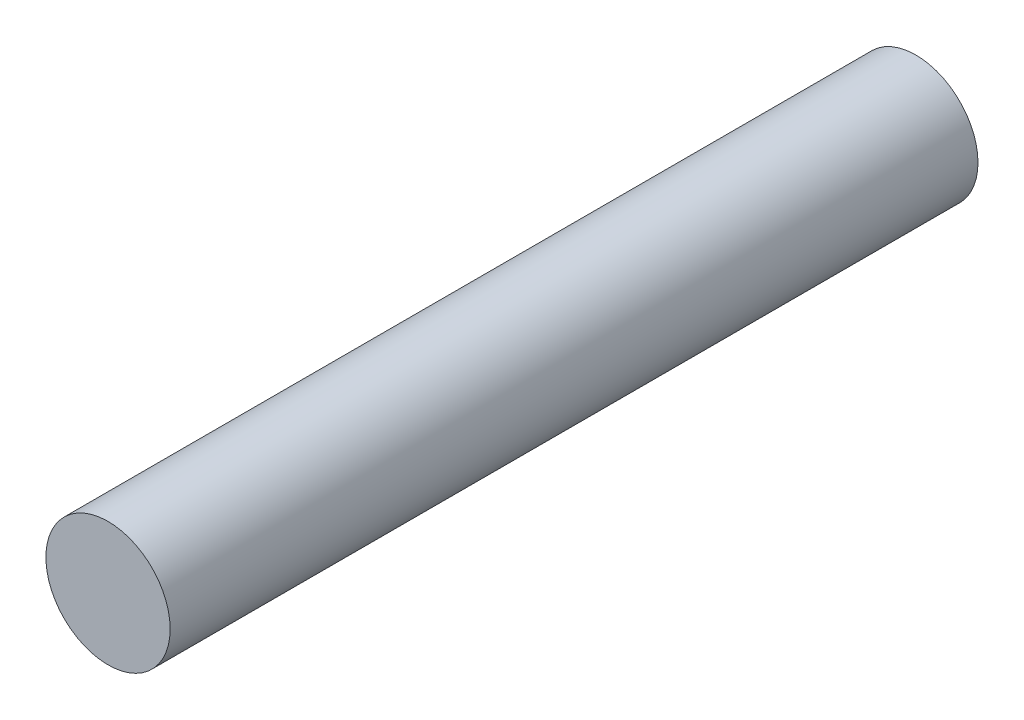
ISO-10303-21;
HEADER;
FILE_DESCRIPTION(('STEP AP214'),'2;1');
FILE_NAME('part.step','',(''),(''),'','','');
FILE_SCHEMA(('AUTOMOTIVE_DESIGN { 1 0 10303 214 1 1 1 1 }'));
ENDSEC;
DATA;
#1=APPLICATION_CONTEXT('core data for automotive mechanical design processes');
#2=APPLICATION_PROTOCOL_DEFINITION('international standard','automotive_design',2000,#1);
#3=PRODUCT_CONTEXT('',#1,'mechanical');
#4=PRODUCT('Part','Part','',(#3));
#5=PRODUCT_RELATED_PRODUCT_CATEGORY('part','',(#4));
#6=PRODUCT_DEFINITION_FORMATION('','',#4);
#7=PRODUCT_DEFINITION_CONTEXT('part definition',#1,'design');
#8=PRODUCT_DEFINITION('design','',#6,#7);
#9=PRODUCT_DEFINITION_SHAPE('','',#8);
#10=(LENGTH_UNIT() NAMED_UNIT(*) SI_UNIT(.MILLI.,.METRE.));
#11=(NAMED_UNIT(*) PLANE_ANGLE_UNIT() SI_UNIT($,.RADIAN.));
#12=(NAMED_UNIT(*) SI_UNIT($,.STERADIAN.) SOLID_ANGLE_UNIT());
#13=UNCERTAINTY_MEASURE_WITH_UNIT(LENGTH_MEASURE(1.E-05),#10,'distance_accuracy_value','');
#14=(GEOMETRIC_REPRESENTATION_CONTEXT(3) GLOBAL_UNCERTAINTY_ASSIGNED_CONTEXT((#13)) GLOBAL_UNIT_ASSIGNED_CONTEXT((#10,
#11,#12)) REPRESENTATION_CONTEXT('',''));
#15=CARTESIAN_POINT('',(0.,0.,0.));
#16=DIRECTION('',(0.,0.,1.));
#17=DIRECTION('',(1.,0.,0.));
#18=AXIS2_PLACEMENT_3D('',#15,#16,#17);
#19=CARTESIAN_POINT('',(0.,0.,6.5));
#20=DIRECTION('',(0.,0.,-1.));
#21=DIRECTION('',(-1.,0.,0.));
#22=AXIS2_PLACEMENT_3D('',#19,#20,#21);
#23=CYLINDRICAL_SURFACE('',#22,0.5);
#24=CARTESIAN_POINT('',(0.,0.,6.5));
#25=DIRECTION('',(0.,0.,1.));
#26=DIRECTION('',(1.,0.,0.));
#27=AXIS2_PLACEMENT_3D('',#24,#25,#26);
#28=CIRCLE('',#27,0.5);
#29=CARTESIAN_POINT('',(0.5,0.,6.5));
#30=VERTEX_POINT('',#29);
#31=EDGE_CURVE('E10',#30,#30,#28,.T.);
#32=ORIENTED_EDGE('',*,*,#31,.F.);
#33=EDGE_LOOP('',(#32));
#34=FACE_BOUND('',#33,.T.);
#35=CARTESIAN_POINT('',(0.,0.,0.));
#36=DIRECTION('',(0.,0.,1.));
#37=DIRECTION('',(1.,0.,0.));
#38=AXIS2_PLACEMENT_3D('',#35,#36,#37);
#39=CIRCLE('',#38,0.5);
#40=CARTESIAN_POINT('',(0.5,0.,0.));
#41=VERTEX_POINT('',#40);
#42=EDGE_CURVE('E31',#41,#41,#39,.T.);
#43=ORIENTED_EDGE('',*,*,#42,.T.);
#44=EDGE_LOOP('',(#43));
#45=FACE_BOUND('',#44,.T.);
#46=ADVANCED_FACE('F28',(#34,#45),#23,.T.);
#47=CARTESIAN_POINT('',(0.,0.,6.5));
#48=DIRECTION('',(0.,0.,1.));
#49=DIRECTION('',(1.,0.,0.));
#50=AXIS2_PLACEMENT_3D('',#47,#48,#49);
#51=PLANE('',#50);
#52=ORIENTED_EDGE('',*,*,#31,.T.);
#53=EDGE_LOOP('',(#52));
#54=FACE_BOUND('',#53,.T.);
#55=ADVANCED_FACE('F43',(#54),#51,.T.);
#56=CARTESIAN_POINT('',(0.,0.,0.));
#57=DIRECTION('',(0.,0.,1.));
#58=DIRECTION('',(1.,0.,0.));
#59=AXIS2_PLACEMENT_3D('',#56,#57,#58);
#60=PLANE('',#59);
#61=ORIENTED_EDGE('',*,*,#42,.F.);
#62=EDGE_LOOP('',(#61));
#63=FACE_BOUND('',#62,.T.);
#64=ADVANCED_FACE('F41',(#63),#60,.F.);
#65=CLOSED_SHELL('',(#46,#55,#64));
#66=MANIFOLD_SOLID_BREP('B2',#65);
#67=ADVANCED_BREP_SHAPE_REPRESENTATION('',(#18,#66),#14);
#68=SHAPE_DEFINITION_REPRESENTATION(#9,#67);
ENDSEC;
END-ISO-10303-21;
